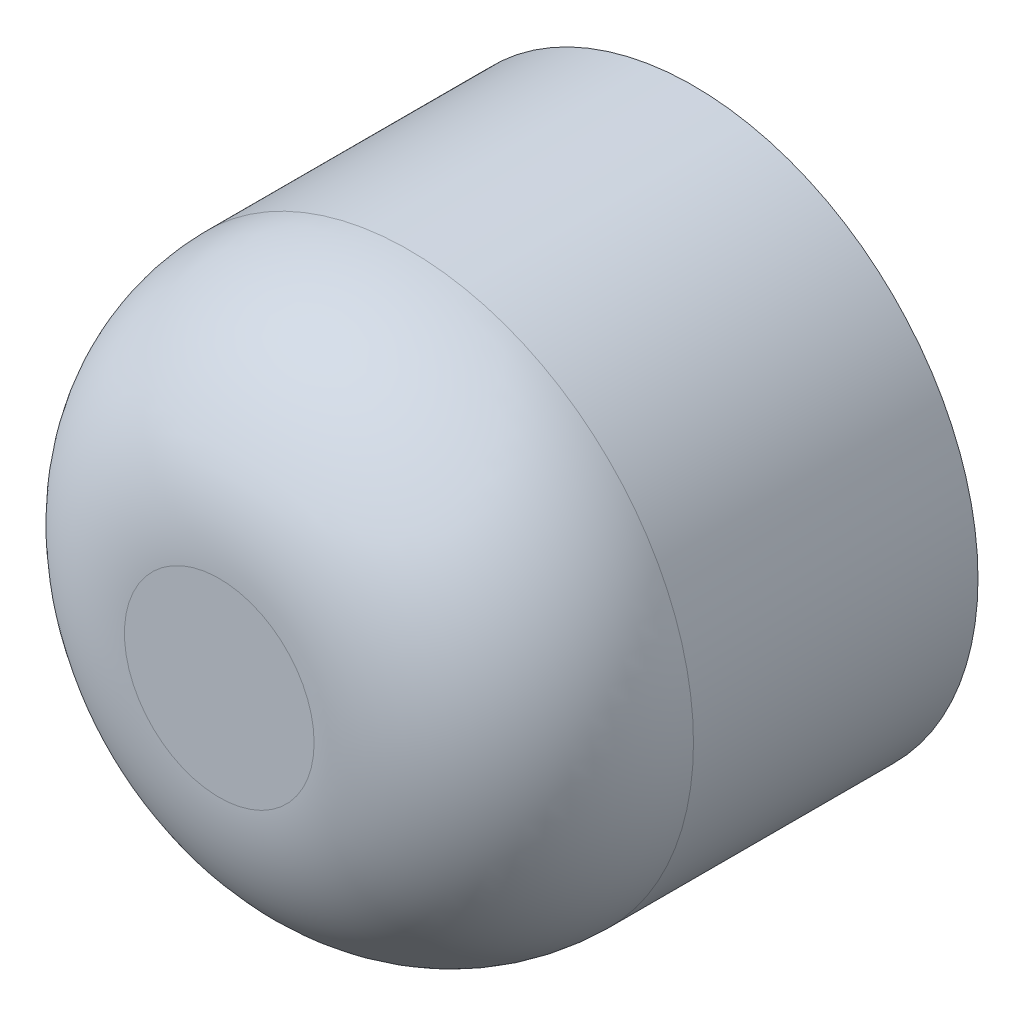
ISO-10303-21;
HEADER;
FILE_DESCRIPTION(('STEP AP214'),'2;1');
FILE_NAME('part.step','',(''),(''),'','','');
FILE_SCHEMA(('AUTOMOTIVE_DESIGN { 1 0 10303 214 1 1 1 1 }'));
ENDSEC;
DATA;
#1=APPLICATION_CONTEXT('core data for automotive mechanical design processes');
#2=APPLICATION_PROTOCOL_DEFINITION('international standard','automotive_design',2000,#1);
#3=PRODUCT_CONTEXT('',#1,'mechanical');
#4=PRODUCT('Part','Part','',(#3));
#5=PRODUCT_RELATED_PRODUCT_CATEGORY('part','',(#4));
#6=PRODUCT_DEFINITION_FORMATION('','',#4);
#7=PRODUCT_DEFINITION_CONTEXT('part definition',#1,'design');
#8=PRODUCT_DEFINITION('design','',#6,#7);
#9=PRODUCT_DEFINITION_SHAPE('','',#8);
#10=(LENGTH_UNIT() NAMED_UNIT(*) SI_UNIT(.MILLI.,.METRE.));
#11=(NAMED_UNIT(*) PLANE_ANGLE_UNIT() SI_UNIT($,.RADIAN.));
#12=(NAMED_UNIT(*) SI_UNIT($,.STERADIAN.) SOLID_ANGLE_UNIT());
#13=UNCERTAINTY_MEASURE_WITH_UNIT(LENGTH_MEASURE(1.E-05),#10,'distance_accuracy_value','');
#14=(GEOMETRIC_REPRESENTATION_CONTEXT(3) GLOBAL_UNCERTAINTY_ASSIGNED_CONTEXT((#13)) GLOBAL_UNIT_ASSIGNED_CONTEXT((#10,
#11,#12)) REPRESENTATION_CONTEXT('',''));
#15=CARTESIAN_POINT('',(0.,0.,0.));
#16=DIRECTION('',(0.,0.,1.));
#17=DIRECTION('',(1.,0.,0.));
#18=AXIS2_PLACEMENT_3D('',#15,#16,#17);
#19=CARTESIAN_POINT('',(0.,0.,10.));
#20=DIRECTION('',(0.,0.,-1.));
#21=DIRECTION('',(-1.,0.,0.));
#22=AXIS2_PLACEMENT_3D('',#19,#20,#21);
#23=CYLINDRICAL_SURFACE('',#22,6.);
#24=CARTESIAN_POINT('',(0.,0.,6.));
#25=DIRECTION('',(0.,0.,1.));
#26=DIRECTION('',(1.,0.,0.));
#27=AXIS2_PLACEMENT_3D('',#24,#25,#26);
#28=CIRCLE('',#27,6.);
#29=CARTESIAN_POINT('',(6.,0.,6.));
#30=VERTEX_POINT('',#29);
#31=EDGE_CURVE('E10',#30,#30,#28,.F.);
#32=ORIENTED_EDGE('',*,*,#31,.T.);
#33=EDGE_LOOP('',(#32));
#34=FACE_BOUND('',#33,.T.);
#35=CARTESIAN_POINT('',(0.,0.,0.));
#36=DIRECTION('',(0.,0.,1.));
#37=DIRECTION('',(1.,0.,0.));
#38=AXIS2_PLACEMENT_3D('',#35,#36,#37);
#39=CIRCLE('',#38,6.);
#40=CARTESIAN_POINT('',(6.,0.,0.));
#41=VERTEX_POINT('',#40);
#42=EDGE_CURVE('E42',#41,#41,#39,.T.);
#43=ORIENTED_EDGE('',*,*,#42,.T.);
#44=EDGE_LOOP('',(#43));
#45=FACE_BOUND('',#44,.T.);
#46=ADVANCED_FACE('F31',(#34,#45),#23,.T.);
#47=CARTESIAN_POINT('',(0.,0.,10.));
#48=DIRECTION('',(0.,0.,1.));
#49=DIRECTION('',(1.,0.,0.));
#50=AXIS2_PLACEMENT_3D('',#47,#48,#49);
#51=PLANE('',#50);
#52=CARTESIAN_POINT('',(0.,0.,10.));
#53=DIRECTION('',(0.,0.,1.));
#54=DIRECTION('',(1.,0.,0.));
#55=AXIS2_PLACEMENT_3D('',#52,#53,#54);
#56=CIRCLE('',#55,2.);
#57=CARTESIAN_POINT('',(2.,0.,10.));
#58=VERTEX_POINT('',#57);
#59=EDGE_CURVE('E38',#58,#58,#56,.T.);
#60=ORIENTED_EDGE('',*,*,#59,.T.);
#61=EDGE_LOOP('',(#60));
#62=FACE_BOUND('',#61,.T.);
#63=ADVANCED_FACE('F52',(#62),#51,.T.);
#64=CARTESIAN_POINT('',(0.,0.,0.));
#65=DIRECTION('',(0.,0.,1.));
#66=DIRECTION('',(1.,0.,0.));
#67=AXIS2_PLACEMENT_3D('',#64,#65,#66);
#68=PLANE('',#67);
#69=ORIENTED_EDGE('',*,*,#42,.F.);
#70=EDGE_LOOP('',(#69));
#71=FACE_BOUND('',#70,.T.);
#72=ADVANCED_FACE('F50',(#71),#68,.F.);
#73=CARTESIAN_POINT('',(0.,0.,6.));
#74=DIRECTION('',(0.,0.,1.));
#75=DIRECTION('',(1.,0.,0.));
#76=AXIS2_PLACEMENT_3D('',#73,#74,#75);
#77=DEGENERATE_TOROIDAL_SURFACE('',#76,2.,4.,.T.);
#78=ORIENTED_EDGE('',*,*,#31,.F.);
#79=EDGE_LOOP('',(#78));
#80=FACE_BOUND('',#79,.T.);
#81=ORIENTED_EDGE('',*,*,#59,.F.);
#82=EDGE_LOOP('',(#81));
#83=FACE_BOUND('',#82,.T.);
#84=ADVANCED_FACE('F33',(#80,#83),#77,.T.);
#85=CLOSED_SHELL('',(#46,#63,#72,#84));
#86=MANIFOLD_SOLID_BREP('B2',#85);
#87=ADVANCED_BREP_SHAPE_REPRESENTATION('',(#18,#86),#14);
#88=SHAPE_DEFINITION_REPRESENTATION(#9,#87);
ENDSEC;
END-ISO-10303-21;
